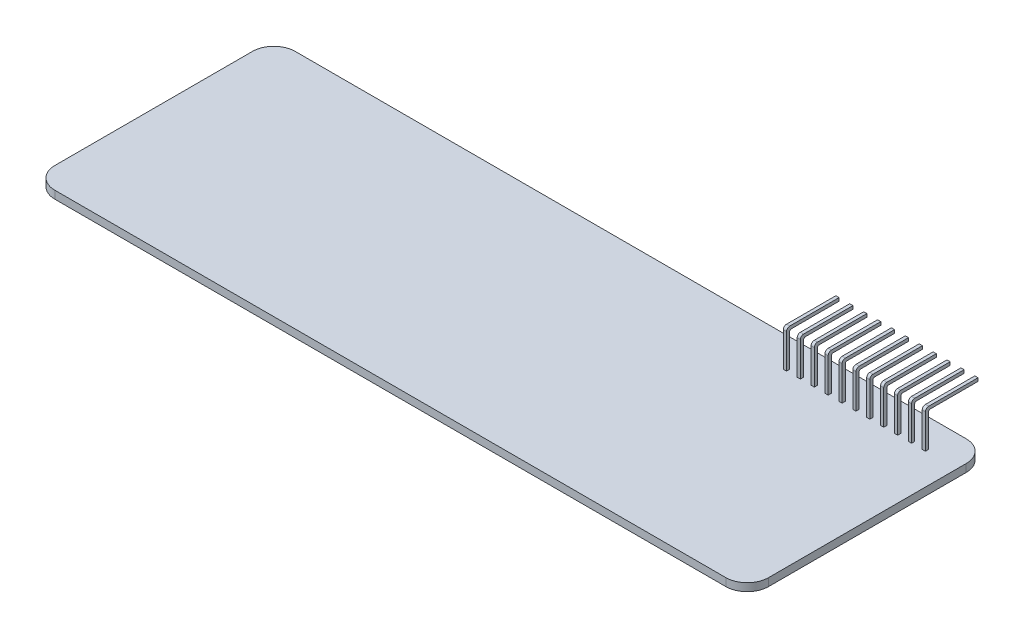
from build123d import *

# Parameters (mm, degrees)
SKIZZE2_W                            = 66.8
SKIZZE2_H                            = 0.73
LINEAR_AUSTRAGEN1_DEPTH              = 22.5
VERRUNDUNG1_R                        = 2
VERRUNDUNG2_R                        = 2
VERRUNDUNG3_R                        = 2
VERRUNDUNG4_R                        = 2
LINEAR_AUSTRAGEN2_DEPTH              = 14
SKIZZE6_W                            = 14
SKIZZE6_H                            = 0.3
LINEAR_AUSTRAGEN3_DEPTH              = 2
SCHNITT_LINEAR_AUSTRAGEN4_DEPTH      = 10
SCHNITT_LINEAR_AUSTRAGEN4_DEPTH_BACK = 10
SKIZZE4_W                            = 1
SKIZZE4_H                            = 5.262638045
SCHNITT_LINEAR_AUSTRAGEN5_DEPTH      = 10
SCHNITT_LINEAR_AUSTRAGEN5_DEPTH_BACK = 10
SKIZZE5_W                            = 1
SKIZZE5_H                            = 4.50377923


with BuildPart() as part:
    # Skizze2 → Linear austragen1 (new body)
    with BuildSketch(Plane.XY):
        with Locations((0, -7.375)):
            Rectangle(SKIZZE2_W, SKIZZE2_H)
    extrude(amount=LINEAR_AUSTRAGEN1_DEPTH)

    # Verrundung1
    verrundung1_edges = [part.edges().sort_by_distance(p)[0] for p in [
        (33.4, -7.375, 22.5),
    ]]
    fillet(verrundung1_edges, radius=VERRUNDUNG1_R)

    # Verrundung2
    verrundung2_edges = [part.edges().sort_by_distance(p)[0] for p in [
        (-33.4, -7.375, 22.5),
    ]]
    fillet(verrundung2_edges, radius=VERRUNDUNG2_R)

    # Verrundung3
    verrundung3_edges = [part.edges().sort_by_distance(p)[0] for p in [
        (-33.4, -7.375, 0),
    ]]
    fillet(verrundung3_edges, radius=VERRUNDUNG3_R)

    # Verrundung4
    verrundung4_edges = [part.edges().sort_by_distance(p)[0] for p in [
        (33.4, -7.375, 0),
    ]]
    fillet(verrundung4_edges, radius=VERRUNDUNG4_R)

    # Skizze3 → Linear austragen2 (add)
    with BuildSketch(Plane.ZY.offset(-30.5)):
        with BuildLine():
            Line((0.0001, -3.51), (2.621394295, -3.51))
            ThreePointArc((2.621394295, -3.51), (2.833526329, -3.597867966), (2.921394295, -3.81))
            Line((2.921394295, -3.81), (2.921394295, -7.64))
            Line((2.921394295, -7.64), (2.621394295, -7.64))
            Line((2.621394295, -7.64), (2.621394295, -3.96))
            ThreePointArc((2.621394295, -3.96), (2.577460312, -3.853933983), (2.471394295, -3.81))
            Line((2.471394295, -3.81), (0.0001, -3.81))
            Line((0.0001, -3.81), (0.0001, -3.51))
        make_face()
    extrude(amount=LINEAR_AUSTRAGEN2_DEPTH)

    # Skizze6 → Linear austragen3 (add)
    with BuildSketch(Plane(origin=(0, 0, 0.0001), x_dir=(-1, 0, 0), z_dir=(0, 0, -1))):
        with Locations((-23.5, -3.66)):
            Rectangle(SKIZZE6_W, SKIZZE6_H)
    extrude(amount=LINEAR_AUSTRAGEN3_DEPTH)

    # Skizze4 → Schnitt-Linear austragen4 (cut, two sides: drawn at the far end of the back side and taken through both)
    with BuildSketch(Plane(origin=(0, 0, -1.9999), x_dir=(-1, 0, 0), z_dir=(0, 0, -1)).offset(-SCHNITT_LINEAR_AUSTRAGEN4_DEPTH_BACK)):
        with Locations((-29.7, -4.378680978)):
            Rectangle(SKIZZE4_W, SKIZZE4_H)
    extrude(amount=SCHNITT_LINEAR_AUSTRAGEN4_DEPTH + SCHNITT_LINEAR_AUSTRAGEN4_DEPTH_BACK, mode=Mode.SUBTRACT)

    # Skizze5 → Schnitt-Linear austragen5 (cut, two sides: drawn at the far end of the back side and taken through both)
    with BuildSketch(Plane(origin=(0, 0, 0), x_dir=(-1, 0, 0), z_dir=(0, 0, -1)).offset(-SCHNITT_LINEAR_AUSTRAGEN5_DEPTH_BACK)):
        with Locations((-28.4, -4.758110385)):
            Rectangle(SKIZZE5_W, SKIZZE5_H)
        with Locations((-27.1, -4.758110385)):
            Rectangle(SKIZZE5_W, SKIZZE5_H)
        with Locations((-25.8, -4.758110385)):
            Rectangle(SKIZZE5_W, SKIZZE5_H)
        with Locations((-24.5, -4.758110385)):
            Rectangle(SKIZZE5_W, SKIZZE5_H)
        with Locations((-23.2, -4.758110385)):
            Rectangle(SKIZZE5_W, SKIZZE5_H)
        with Locations((-21.9, -4.758110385)):
            Rectangle(SKIZZE5_W, SKIZZE5_H)
        with Locations((-20.6, -4.758110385)):
            Rectangle(SKIZZE5_W, SKIZZE5_H)
        with Locations((-19.3, -4.758110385)):
            Rectangle(SKIZZE5_W, SKIZZE5_H)
        with Locations((-18, -4.758110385)):
            Rectangle(SKIZZE5_W, SKIZZE5_H)
        with Locations((-16.7, -4.758110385)):
            Rectangle(SKIZZE5_W, SKIZZE5_H)
    extrude(amount=SCHNITT_LINEAR_AUSTRAGEN5_DEPTH + SCHNITT_LINEAR_AUSTRAGEN5_DEPTH_BACK, mode=Mode.SUBTRACT)


solid = part.part
